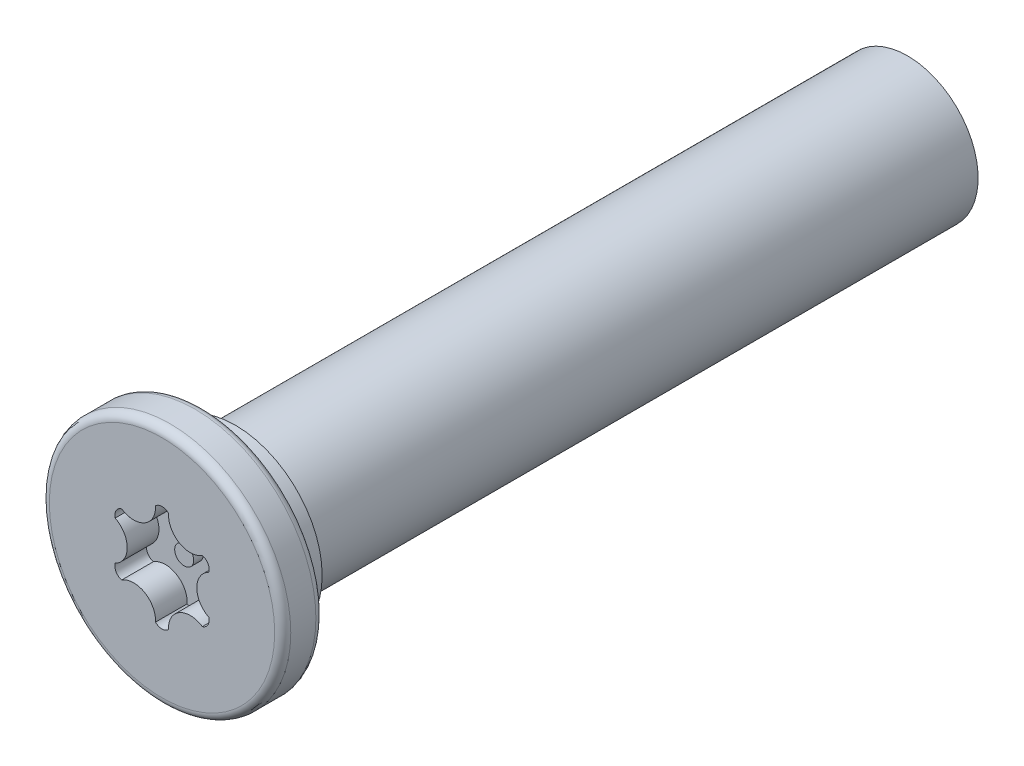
ISO-10303-21;
HEADER;
FILE_DESCRIPTION(('STEP AP214'),'2;1');
FILE_NAME('part.step','',(''),(''),'','','');
FILE_SCHEMA(('AUTOMOTIVE_DESIGN { 1 0 10303 214 1 1 1 1 }'));
ENDSEC;
DATA;
#1=APPLICATION_CONTEXT('core data for automotive mechanical design processes');
#2=APPLICATION_PROTOCOL_DEFINITION('international standard','automotive_design',2000,#1);
#3=PRODUCT_CONTEXT('',#1,'mechanical');
#4=PRODUCT('Part','Part','',(#3));
#5=PRODUCT_RELATED_PRODUCT_CATEGORY('part','',(#4));
#6=PRODUCT_DEFINITION_FORMATION('','',#4);
#7=PRODUCT_DEFINITION_CONTEXT('part definition',#1,'design');
#8=PRODUCT_DEFINITION('design','',#6,#7);
#9=PRODUCT_DEFINITION_SHAPE('','',#8);
#10=(LENGTH_UNIT() NAMED_UNIT(*) SI_UNIT(.MILLI.,.METRE.));
#11=(NAMED_UNIT(*) PLANE_ANGLE_UNIT() SI_UNIT($,.RADIAN.));
#12=(NAMED_UNIT(*) SI_UNIT($,.STERADIAN.) SOLID_ANGLE_UNIT());
#13=UNCERTAINTY_MEASURE_WITH_UNIT(LENGTH_MEASURE(1.E-05),#10,'distance_accuracy_value','');
#14=(GEOMETRIC_REPRESENTATION_CONTEXT(3) GLOBAL_UNCERTAINTY_ASSIGNED_CONTEXT((#13)) GLOBAL_UNIT_ASSIGNED_CONTEXT((#10,
#11,#12)) REPRESENTATION_CONTEXT('',''));
#15=CARTESIAN_POINT('',(0.,0.,0.));
#16=DIRECTION('',(0.,0.,1.));
#17=DIRECTION('',(1.,0.,0.));
#18=AXIS2_PLACEMENT_3D('',#15,#16,#17);
#19=CARTESIAN_POINT('',(0.,0.,0.));
#20=DIRECTION('',(0.,0.,1.));
#21=DIRECTION('',(1.,0.,0.));
#22=AXIS2_PLACEMENT_3D('',#19,#20,#21);
#23=PLANE('',#22);
#24=CARTESIAN_POINT('',(0.,0.,0.));
#25=DIRECTION('',(0.,0.,1.));
#26=DIRECTION('',(1.,0.,0.));
#27=AXIS2_PLACEMENT_3D('',#24,#25,#26);
#28=CIRCLE('',#27,3.55599999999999);
#29=CARTESIAN_POINT('',(3.55599999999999,0.,0.));
#30=VERTEX_POINT('',#29);
#31=EDGE_CURVE('E54',#30,#30,#28,.T.);
#32=ORIENTED_EDGE('',*,*,#31,.T.);
#33=EDGE_LOOP('',(#32));
#34=FACE_BOUND('',#33,.T.);
#35=CARTESIAN_POINT('',(0.893828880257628,1.54815703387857,0.));
#36=DIRECTION('',(0.,0.,1.));
#37=DIRECTION('',(1.,0.,0.));
#38=AXIS2_PLACEMENT_3D('',#35,#36,#37);
#39=CIRCLE('',#38,0.69);
#40=CARTESIAN_POINT('',(0.205060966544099,1.58937306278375,0.));
#41=VERTEX_POINT('',#40);
#42=CARTESIAN_POINT('',(1.27390696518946,0.972274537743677,0.));
#43=VERTEX_POINT('',#42);
#44=EDGE_CURVE('E181',#41,#43,#39,.T.);
#45=ORIENTED_EDGE('',*,*,#44,.T.);
#46=CARTESIAN_POINT('',(1.19884944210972,0.692156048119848,0.));
#47=DIRECTION('',(0.,0.,1.));
#48=DIRECTION('',(1.,0.,0.));
#49=AXIS2_PLACEMENT_3D('',#46,#47,#48);
#50=CIRCLE('',#49,0.29);
#51=CARTESIAN_POINT('',(1.47896793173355,0.617098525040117,0.));
#52=VERTEX_POINT('',#51);
#53=EDGE_CURVE('E61',#43,#52,#50,.F.);
#54=ORIENTED_EDGE('',*,*,#53,.T.);
#55=CARTESIAN_POINT('',(1.78765776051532,0.,0.));
#56=DIRECTION('',(0.,0.,1.));
#57=DIRECTION('',(1.,0.,0.));
#58=AXIS2_PLACEMENT_3D('',#55,#56,#57);
#59=CIRCLE('',#58,0.69);
#60=CARTESIAN_POINT('',(1.47896793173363,-0.617098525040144,0.));
#61=VERTEX_POINT('',#60);
#62=EDGE_CURVE('E111',#52,#61,#59,.T.);
#63=ORIENTED_EDGE('',*,*,#62,.T.);
#64=CARTESIAN_POINT('',(1.1988494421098,-0.692156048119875,0.));
#65=DIRECTION('',(0.,0.,1.));
#66=DIRECTION('',(1.,0.,0.));
#67=AXIS2_PLACEMENT_3D('',#64,#65,#66);
#68=CIRCLE('',#67,0.29);
#69=CARTESIAN_POINT('',(1.27390696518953,-0.972274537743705,0.));
#70=VERTEX_POINT('',#69);
#71=EDGE_CURVE('E216',#61,#70,#68,.F.);
#72=ORIENTED_EDGE('',*,*,#71,.T.);
#73=CARTESIAN_POINT('',(0.893828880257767,-1.54815703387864,0.));
#74=DIRECTION('',(0.,0.,1.));
#75=DIRECTION('',(1.,0.,0.));
#76=AXIS2_PLACEMENT_3D('',#73,#74,#75);
#77=CIRCLE('',#76,0.69);
#78=CARTESIAN_POINT('',(0.205060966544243,-1.5893730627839,0.));
#79=VERTEX_POINT('',#78);
#80=EDGE_CURVE('E160',#70,#79,#77,.T.);
#81=ORIENTED_EDGE('',*,*,#80,.T.);
#82=CARTESIAN_POINT('',(1.43067375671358E-13,-1.3843120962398,0.));
#83=DIRECTION('',(0.,0.,1.));
#84=DIRECTION('',(1.,0.,0.));
#85=AXIS2_PLACEMENT_3D('',#82,#83,#84);
#86=CIRCLE('',#85,0.29);
#87=CARTESIAN_POINT('',(-0.205060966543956,-1.5893730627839,0.));
#88=VERTEX_POINT('',#87);
#89=EDGE_CURVE('E210',#79,#88,#86,.F.);
#90=ORIENTED_EDGE('',*,*,#89,.T.);
#91=CARTESIAN_POINT('',(-0.893828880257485,-1.54815703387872,0.));
#92=DIRECTION('',(0.,0.,1.));
#93=DIRECTION('',(1.,0.,0.));
#94=AXIS2_PLACEMENT_3D('',#91,#92,#93);
#95=CIRCLE('',#94,0.69);
#96=CARTESIAN_POINT('',(-1.27390696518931,-0.97227453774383,0.));
#97=VERTEX_POINT('',#96);
#98=EDGE_CURVE('E206',#88,#97,#95,.T.);
#99=ORIENTED_EDGE('',*,*,#98,.T.);
#100=CARTESIAN_POINT('',(-1.19884944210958,-0.69215604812,0.));
#101=DIRECTION('',(0.,0.,1.));
#102=DIRECTION('',(1.,0.,0.));
#103=AXIS2_PLACEMENT_3D('',#100,#101,#102);
#104=CIRCLE('',#103,0.29);
#105=CARTESIAN_POINT('',(-1.47896793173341,-0.617098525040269,0.));
#106=VERTEX_POINT('',#105);
#107=EDGE_CURVE('E202',#97,#106,#104,.F.);
#108=ORIENTED_EDGE('',*,*,#107,.T.);
#109=CARTESIAN_POINT('',(-1.78765776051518,-1.56674837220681E-13,0.));
#110=DIRECTION('',(0.,0.,1.));
#111=DIRECTION('',(1.,0.,0.));
#112=AXIS2_PLACEMENT_3D('',#109,#110,#111);
#113=CIRCLE('',#112,0.69);
#114=CARTESIAN_POINT('',(-1.47896793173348,0.617098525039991,0.));
#115=VERTEX_POINT('',#114);
#116=EDGE_CURVE('E198',#106,#115,#113,.T.);
#117=ORIENTED_EDGE('',*,*,#116,.T.);
#118=CARTESIAN_POINT('',(-1.19884944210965,0.692156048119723,0.));
#119=DIRECTION('',(0.,0.,1.));
#120=DIRECTION('',(1.,0.,0.));
#121=AXIS2_PLACEMENT_3D('',#118,#119,#120);
#122=CIRCLE('',#121,0.29);
#123=CARTESIAN_POINT('',(-1.27390696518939,0.972274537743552,0.));
#124=VERTEX_POINT('',#123);
#125=EDGE_CURVE('E194',#115,#124,#122,.F.);
#126=ORIENTED_EDGE('',*,*,#125,.T.);
#127=CARTESIAN_POINT('',(-0.893828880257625,1.54815703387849,0.));
#128=DIRECTION('',(0.,0.,1.));
#129=DIRECTION('',(1.,0.,0.));
#130=AXIS2_PLACEMENT_3D('',#127,#128,#129);
#131=CIRCLE('',#130,0.690000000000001);
#132=CARTESIAN_POINT('',(-0.205060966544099,1.58937306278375,0.));
#133=VERTEX_POINT('',#132);
#134=EDGE_CURVE('E190',#124,#133,#131,.T.);
#135=ORIENTED_EDGE('',*,*,#134,.T.);
#136=CARTESIAN_POINT('',(0.,1.38431209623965,0.));
#137=DIRECTION('',(0.,0.,1.));
#138=DIRECTION('',(1.,0.,0.));
#139=AXIS2_PLACEMENT_3D('',#136,#137,#138);
#140=CIRCLE('',#139,0.29);
#141=EDGE_CURVE('E186',#133,#41,#140,.F.);
#142=ORIENTED_EDGE('',*,*,#141,.T.);
#143=EDGE_LOOP('',(#45,#54,#63,#72,#81,#90,#99,#108,#117,#126,#135,#142));
#144=FACE_BOUND('',#143,.T.);
#145=ADVANCED_FACE('F45',(#34,#144),#23,.T.);
#146=CARTESIAN_POINT('',(0.,0.,-1.3));
#147=DIRECTION('',(0.,0.,1.));
#148=DIRECTION('',(1.,0.,0.));
#149=AXIS2_PLACEMENT_3D('',#146,#147,#148);
#150=PLANE('',#149);
#151=CARTESIAN_POINT('',(0.,0.,-1.3));
#152=DIRECTION('',(0.,0.,1.));
#153=DIRECTION('',(1.,0.,0.));
#154=AXIS2_PLACEMENT_3D('',#151,#152,#153);
#155=CIRCLE('',#154,2.738000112);
#156=CARTESIAN_POINT('',(2.738000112,0.,-1.3));
#157=VERTEX_POINT('',#156);
#158=EDGE_CURVE('E11',#157,#157,#155,.F.);
#159=ORIENTED_EDGE('',*,*,#158,.F.);
#160=EDGE_LOOP('',(#159));
#161=FACE_BOUND('',#160,.T.);
#162=CARTESIAN_POINT('',(0.,0.,-1.3));
#163=DIRECTION('',(0.,0.,1.));
#164=DIRECTION('',(1.,0.,0.));
#165=AXIS2_PLACEMENT_3D('',#162,#163,#164);
#166=CIRCLE('',#165,3.55599999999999);
#167=CARTESIAN_POINT('',(3.55599999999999,0.,-1.3));
#168=VERTEX_POINT('',#167);
#169=EDGE_CURVE('E260',#168,#168,#166,.F.);
#170=ORIENTED_EDGE('',*,*,#169,.T.);
#171=EDGE_LOOP('',(#170));
#172=FACE_BOUND('',#171,.T.);
#173=ADVANCED_FACE('F283',(#161,#172),#150,.F.);
#174=CARTESIAN_POINT('',(0.,0.,-1.3));
#175=DIRECTION('',(0.,0.,1.));
#176=DIRECTION('',(1.,0.,0.));
#177=AXIS2_PLACEMENT_3D('',#174,#175,#176);
#178=CYLINDRICAL_SURFACE('',#177,3.80999999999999);
#179=CARTESIAN_POINT('',(0.,0.,-1.046));
#180=DIRECTION('',(0.,0.,1.));
#181=DIRECTION('',(1.,0.,0.));
#182=AXIS2_PLACEMENT_3D('',#179,#180,#181);
#183=CIRCLE('',#182,3.80999999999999);
#184=CARTESIAN_POINT('',(3.80999999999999,0.,-1.046));
#185=VERTEX_POINT('',#184);
#186=EDGE_CURVE('E256',#185,#185,#183,.T.);
#187=ORIENTED_EDGE('',*,*,#186,.T.);
#188=EDGE_LOOP('',(#187));
#189=FACE_BOUND('',#188,.T.);
#190=CARTESIAN_POINT('',(0.,0.,-0.254));
#191=DIRECTION('',(0.,0.,1.));
#192=DIRECTION('',(1.,0.,0.));
#193=AXIS2_PLACEMENT_3D('',#190,#191,#192);
#194=CIRCLE('',#193,3.80999999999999);
#195=CARTESIAN_POINT('',(3.80999999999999,0.,-0.254));
#196=VERTEX_POINT('',#195);
#197=EDGE_CURVE('E225',#196,#196,#194,.F.);
#198=ORIENTED_EDGE('',*,*,#197,.T.);
#199=EDGE_LOOP('',(#198));
#200=FACE_BOUND('',#199,.T.);
#201=ADVANCED_FACE('F289',(#189,#200),#178,.T.);
#202=CARTESIAN_POINT('',(1.19884944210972,0.692156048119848,-1.));
#203=DIRECTION('',(0.,0.,1.));
#204=DIRECTION('',(1.,0.,0.));
#205=AXIS2_PLACEMENT_3D('',#202,#203,#204);
#206=CYLINDRICAL_SURFACE('',#205,0.29);
#207=ORIENTED_EDGE('',*,*,#53,.F.);
#208=DIRECTION('',(0.,0.,1.));
#209=VECTOR('',#208,1.);
#210=CARTESIAN_POINT('',(1.27390696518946,0.972274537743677,-1.));
#211=LINE('',#210,#209);
#212=CARTESIAN_POINT('',(1.27390696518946,0.972274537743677,-1.));
#213=VERTEX_POINT('',#212);
#214=EDGE_CURVE('E178',#213,#43,#211,.T.);
#215=ORIENTED_EDGE('',*,*,#214,.F.);
#216=CARTESIAN_POINT('',(1.19884944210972,0.692156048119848,-1.));
#217=DIRECTION('',(0.,0.,1.));
#218=DIRECTION('',(1.,0.,0.));
#219=AXIS2_PLACEMENT_3D('',#216,#217,#218);
#220=CIRCLE('',#219,0.29);
#221=CARTESIAN_POINT('',(1.47896793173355,0.617098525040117,-1.));
#222=VERTEX_POINT('',#221);
#223=EDGE_CURVE('E221',#213,#222,#220,.F.);
#224=ORIENTED_EDGE('',*,*,#223,.T.);
#225=DIRECTION('',(0.,0.,1.));
#226=VECTOR('',#225,1.);
#227=CARTESIAN_POINT('',(1.47896793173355,0.617098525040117,-1.));
#228=LINE('',#227,#226);
#229=EDGE_CURVE('E222',#222,#52,#228,.T.);
#230=ORIENTED_EDGE('',*,*,#229,.T.);
#231=EDGE_LOOP('',(#207,#215,#224,#230));
#232=FACE_BOUND('',#231,.T.);
#233=ADVANCED_FACE('F294',(#232),#206,.F.);
#234=CARTESIAN_POINT('',(1.78765776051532,0.,-1.));
#235=DIRECTION('',(0.,0.,1.));
#236=DIRECTION('',(1.,0.,0.));
#237=AXIS2_PLACEMENT_3D('',#234,#235,#236);
#238=CYLINDRICAL_SURFACE('',#237,0.69);
#239=ORIENTED_EDGE('',*,*,#62,.F.);
#240=ORIENTED_EDGE('',*,*,#229,.F.);
#241=CARTESIAN_POINT('',(1.78765776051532,0.,-1.));
#242=DIRECTION('',(0.,0.,1.));
#243=DIRECTION('',(1.,0.,0.));
#244=AXIS2_PLACEMENT_3D('',#241,#242,#243);
#245=CIRCLE('',#244,0.69);
#246=CARTESIAN_POINT('',(1.47896793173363,-0.617098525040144,-1.));
#247=VERTEX_POINT('',#246);
#248=EDGE_CURVE('E70',#222,#247,#245,.T.);
#249=ORIENTED_EDGE('',*,*,#248,.T.);
#250=DIRECTION('',(0.,0.,1.));
#251=VECTOR('',#250,1.);
#252=CARTESIAN_POINT('',(1.47896793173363,-0.617098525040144,-1.));
#253=LINE('',#252,#251);
#254=EDGE_CURVE('E151',#247,#61,#253,.T.);
#255=ORIENTED_EDGE('',*,*,#254,.T.);
#256=EDGE_LOOP('',(#239,#240,#249,#255));
#257=FACE_BOUND('',#256,.T.);
#258=ADVANCED_FACE('F301',(#257),#238,.T.);
#259=CARTESIAN_POINT('',(1.1988494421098,-0.692156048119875,-1.));
#260=DIRECTION('',(0.,0.,1.));
#261=DIRECTION('',(1.,0.,0.));
#262=AXIS2_PLACEMENT_3D('',#259,#260,#261);
#263=CYLINDRICAL_SURFACE('',#262,0.29);
#264=ORIENTED_EDGE('',*,*,#71,.F.);
#265=ORIENTED_EDGE('',*,*,#254,.F.);
#266=CARTESIAN_POINT('',(1.1988494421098,-0.692156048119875,-1.));
#267=DIRECTION('',(0.,0.,1.));
#268=DIRECTION('',(1.,0.,0.));
#269=AXIS2_PLACEMENT_3D('',#266,#267,#268);
#270=CIRCLE('',#269,0.29);
#271=CARTESIAN_POINT('',(1.27390696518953,-0.972274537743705,-1.));
#272=VERTEX_POINT('',#271);
#273=EDGE_CURVE('E145',#247,#272,#270,.F.);
#274=ORIENTED_EDGE('',*,*,#273,.T.);
#275=DIRECTION('',(0.,0.,1.));
#276=VECTOR('',#275,1.);
#277=CARTESIAN_POINT('',(1.27390696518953,-0.972274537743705,-1.));
#278=LINE('',#277,#276);
#279=EDGE_CURVE('E149',#272,#70,#278,.T.);
#280=ORIENTED_EDGE('',*,*,#279,.T.);
#281=EDGE_LOOP('',(#264,#265,#274,#280));
#282=FACE_BOUND('',#281,.T.);
#283=ADVANCED_FACE('F148',(#282),#263,.F.);
#284=CARTESIAN_POINT('',(0.893828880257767,-1.54815703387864,-1.));
#285=DIRECTION('',(0.,0.,1.));
#286=DIRECTION('',(1.,0.,0.));
#287=AXIS2_PLACEMENT_3D('',#284,#285,#286);
#288=CYLINDRICAL_SURFACE('',#287,0.69);
#289=ORIENTED_EDGE('',*,*,#80,.F.);
#290=ORIENTED_EDGE('',*,*,#279,.F.);
#291=CARTESIAN_POINT('',(0.893828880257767,-1.54815703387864,-1.));
#292=DIRECTION('',(0.,0.,1.));
#293=DIRECTION('',(1.,0.,0.));
#294=AXIS2_PLACEMENT_3D('',#291,#292,#293);
#295=CIRCLE('',#294,0.69);
#296=CARTESIAN_POINT('',(0.205060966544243,-1.5893730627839,-1.));
#297=VERTEX_POINT('',#296);
#298=EDGE_CURVE('E154',#272,#297,#295,.T.);
#299=ORIENTED_EDGE('',*,*,#298,.T.);
#300=DIRECTION('',(0.,0.,1.));
#301=VECTOR('',#300,1.);
#302=CARTESIAN_POINT('',(0.205060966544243,-1.5893730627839,-1.));
#303=LINE('',#302,#301);
#304=EDGE_CURVE('E163',#297,#79,#303,.T.);
#305=ORIENTED_EDGE('',*,*,#304,.T.);
#306=EDGE_LOOP('',(#289,#290,#299,#305));
#307=FACE_BOUND('',#306,.T.);
#308=ADVANCED_FACE('F157',(#307),#288,.T.);
#309=CARTESIAN_POINT('',(1.43067375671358E-13,-1.3843120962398,-1.));
#310=DIRECTION('',(0.,0.,1.));
#311=DIRECTION('',(1.,0.,0.));
#312=AXIS2_PLACEMENT_3D('',#309,#310,#311);
#313=CYLINDRICAL_SURFACE('',#312,0.29);
#314=ORIENTED_EDGE('',*,*,#89,.F.);
#315=ORIENTED_EDGE('',*,*,#304,.F.);
#316=CARTESIAN_POINT('',(1.43067375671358E-13,-1.3843120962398,-1.));
#317=DIRECTION('',(0.,0.,1.));
#318=DIRECTION('',(1.,0.,0.));
#319=AXIS2_PLACEMENT_3D('',#316,#317,#318);
#320=CIRCLE('',#319,0.29);
#321=CARTESIAN_POINT('',(-0.205060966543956,-1.5893730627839,-1.));
#322=VERTEX_POINT('',#321);
#323=EDGE_CURVE('E168',#297,#322,#320,.F.);
#324=ORIENTED_EDGE('',*,*,#323,.T.);
#325=DIRECTION('',(0.,0.,1.));
#326=VECTOR('',#325,1.);
#327=CARTESIAN_POINT('',(-0.205060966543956,-1.5893730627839,-1.));
#328=LINE('',#327,#326);
#329=EDGE_CURVE('E230',#322,#88,#328,.T.);
#330=ORIENTED_EDGE('',*,*,#329,.T.);
#331=EDGE_LOOP('',(#314,#315,#324,#330));
#332=FACE_BOUND('',#331,.T.);
#333=ADVANCED_FACE('F318',(#332),#313,.F.);
#334=CARTESIAN_POINT('',(-0.893828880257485,-1.54815703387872,-1.));
#335=DIRECTION('',(0.,0.,1.));
#336=DIRECTION('',(1.,0.,0.));
#337=AXIS2_PLACEMENT_3D('',#334,#335,#336);
#338=CYLINDRICAL_SURFACE('',#337,0.69);
#339=ORIENTED_EDGE('',*,*,#98,.F.);
#340=ORIENTED_EDGE('',*,*,#329,.F.);
#341=CARTESIAN_POINT('',(-0.893828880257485,-1.54815703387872,-1.));
#342=DIRECTION('',(0.,0.,1.));
#343=DIRECTION('',(1.,0.,0.));
#344=AXIS2_PLACEMENT_3D('',#341,#342,#343);
#345=CIRCLE('',#344,0.69);
#346=CARTESIAN_POINT('',(-1.27390696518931,-0.97227453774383,-1.));
#347=VERTEX_POINT('',#346);
#348=EDGE_CURVE('E172',#322,#347,#345,.T.);
#349=ORIENTED_EDGE('',*,*,#348,.T.);
#350=DIRECTION('',(0.,0.,1.));
#351=VECTOR('',#350,1.);
#352=CARTESIAN_POINT('',(-1.27390696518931,-0.97227453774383,-1.));
#353=LINE('',#352,#351);
#354=EDGE_CURVE('E233',#347,#97,#353,.T.);
#355=ORIENTED_EDGE('',*,*,#354,.T.);
#356=EDGE_LOOP('',(#339,#340,#349,#355));
#357=FACE_BOUND('',#356,.T.);
#358=ADVANCED_FACE('F321',(#357),#338,.T.);
#359=CARTESIAN_POINT('',(-1.19884944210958,-0.69215604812,-1.));
#360=DIRECTION('',(0.,0.,1.));
#361=DIRECTION('',(1.,0.,0.));
#362=AXIS2_PLACEMENT_3D('',#359,#360,#361);
#363=CYLINDRICAL_SURFACE('',#362,0.29);
#364=ORIENTED_EDGE('',*,*,#107,.F.);
#365=ORIENTED_EDGE('',*,*,#354,.F.);
#366=CARTESIAN_POINT('',(-1.19884944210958,-0.69215604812,-1.));
#367=DIRECTION('',(0.,0.,1.));
#368=DIRECTION('',(1.,0.,0.));
#369=AXIS2_PLACEMENT_3D('',#366,#367,#368);
#370=CIRCLE('',#369,0.29);
#371=CARTESIAN_POINT('',(-1.47896793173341,-0.617098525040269,-1.));
#372=VERTEX_POINT('',#371);
#373=EDGE_CURVE('E374',#347,#372,#370,.F.);
#374=ORIENTED_EDGE('',*,*,#373,.T.);
#375=DIRECTION('',(0.,0.,1.));
#376=VECTOR('',#375,1.);
#377=CARTESIAN_POINT('',(-1.47896793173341,-0.617098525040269,-1.));
#378=LINE('',#377,#376);
#379=EDGE_CURVE('E236',#372,#106,#378,.T.);
#380=ORIENTED_EDGE('',*,*,#379,.T.);
#381=EDGE_LOOP('',(#364,#365,#374,#380));
#382=FACE_BOUND('',#381,.T.);
#383=ADVANCED_FACE('F325',(#382),#363,.F.);
#384=CARTESIAN_POINT('',(-1.78765776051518,-1.56674837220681E-13,-1.));
#385=DIRECTION('',(0.,0.,1.));
#386=DIRECTION('',(1.,0.,0.));
#387=AXIS2_PLACEMENT_3D('',#384,#385,#386);
#388=CYLINDRICAL_SURFACE('',#387,0.69);
#389=ORIENTED_EDGE('',*,*,#116,.F.);
#390=ORIENTED_EDGE('',*,*,#379,.F.);
#391=CARTESIAN_POINT('',(-1.78765776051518,-1.56674837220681E-13,-1.));
#392=DIRECTION('',(0.,0.,1.));
#393=DIRECTION('',(1.,0.,0.));
#394=AXIS2_PLACEMENT_3D('',#391,#392,#393);
#395=CIRCLE('',#394,0.69);
#396=CARTESIAN_POINT('',(-1.47896793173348,0.617098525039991,-1.));
#397=VERTEX_POINT('',#396);
#398=EDGE_CURVE('E371',#372,#397,#395,.T.);
#399=ORIENTED_EDGE('',*,*,#398,.T.);
#400=DIRECTION('',(0.,0.,1.));
#401=VECTOR('',#400,1.);
#402=CARTESIAN_POINT('',(-1.47896793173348,0.617098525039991,-1.));
#403=LINE('',#402,#401);
#404=EDGE_CURVE('E239',#397,#115,#403,.T.);
#405=ORIENTED_EDGE('',*,*,#404,.T.);
#406=EDGE_LOOP('',(#389,#390,#399,#405));
#407=FACE_BOUND('',#406,.T.);
#408=ADVANCED_FACE('F329',(#407),#388,.T.);
#409=CARTESIAN_POINT('',(-1.19884944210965,0.692156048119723,-1.));
#410=DIRECTION('',(0.,0.,1.));
#411=DIRECTION('',(1.,0.,0.));
#412=AXIS2_PLACEMENT_3D('',#409,#410,#411);
#413=CYLINDRICAL_SURFACE('',#412,0.29);
#414=ORIENTED_EDGE('',*,*,#125,.F.);
#415=ORIENTED_EDGE('',*,*,#404,.F.);
#416=CARTESIAN_POINT('',(-1.19884944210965,0.692156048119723,-1.));
#417=DIRECTION('',(0.,0.,1.));
#418=DIRECTION('',(1.,0.,0.));
#419=AXIS2_PLACEMENT_3D('',#416,#417,#418);
#420=CIRCLE('',#419,0.29);
#421=CARTESIAN_POINT('',(-1.27390696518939,0.972274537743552,-1.));
#422=VERTEX_POINT('',#421);
#423=EDGE_CURVE('E364',#397,#422,#420,.F.);
#424=ORIENTED_EDGE('',*,*,#423,.T.);
#425=DIRECTION('',(0.,0.,1.));
#426=VECTOR('',#425,1.);
#427=CARTESIAN_POINT('',(-1.27390696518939,0.972274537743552,-1.));
#428=LINE('',#427,#426);
#429=EDGE_CURVE('E242',#422,#124,#428,.T.);
#430=ORIENTED_EDGE('',*,*,#429,.T.);
#431=EDGE_LOOP('',(#414,#415,#424,#430));
#432=FACE_BOUND('',#431,.T.);
#433=ADVANCED_FACE('F333',(#432),#413,.F.);
#434=CARTESIAN_POINT('',(-0.893828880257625,1.54815703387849,-1.));
#435=DIRECTION('',(0.,0.,1.));
#436=DIRECTION('',(1.,0.,0.));
#437=AXIS2_PLACEMENT_3D('',#434,#435,#436);
#438=CYLINDRICAL_SURFACE('',#437,0.690000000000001);
#439=ORIENTED_EDGE('',*,*,#134,.F.);
#440=ORIENTED_EDGE('',*,*,#429,.F.);
#441=CARTESIAN_POINT('',(-0.893828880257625,1.54815703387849,-1.));
#442=DIRECTION('',(0.,0.,1.));
#443=DIRECTION('',(1.,0.,0.));
#444=AXIS2_PLACEMENT_3D('',#441,#442,#443);
#445=CIRCLE('',#444,0.690000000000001);
#446=CARTESIAN_POINT('',(-0.205060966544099,1.58937306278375,-1.));
#447=VERTEX_POINT('',#446);
#448=EDGE_CURVE('E360',#422,#447,#445,.T.);
#449=ORIENTED_EDGE('',*,*,#448,.T.);
#450=DIRECTION('',(0.,0.,1.));
#451=VECTOR('',#450,1.);
#452=CARTESIAN_POINT('',(-0.205060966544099,1.58937306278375,-1.));
#453=LINE('',#452,#451);
#454=EDGE_CURVE('E245',#447,#133,#453,.T.);
#455=ORIENTED_EDGE('',*,*,#454,.T.);
#456=EDGE_LOOP('',(#439,#440,#449,#455));
#457=FACE_BOUND('',#456,.T.);
#458=ADVANCED_FACE('F337',(#457),#438,.T.);
#459=CARTESIAN_POINT('',(0.,1.38431209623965,-1.));
#460=DIRECTION('',(0.,0.,1.));
#461=DIRECTION('',(1.,0.,0.));
#462=AXIS2_PLACEMENT_3D('',#459,#460,#461);
#463=CYLINDRICAL_SURFACE('',#462,0.29);
#464=ORIENTED_EDGE('',*,*,#141,.F.);
#465=ORIENTED_EDGE('',*,*,#454,.F.);
#466=CARTESIAN_POINT('',(0.,1.38431209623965,-1.));
#467=DIRECTION('',(0.,0.,1.));
#468=DIRECTION('',(1.,0.,0.));
#469=AXIS2_PLACEMENT_3D('',#466,#467,#468);
#470=CIRCLE('',#469,0.29);
#471=CARTESIAN_POINT('',(0.205060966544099,1.58937306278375,-1.));
#472=VERTEX_POINT('',#471);
#473=EDGE_CURVE('E357',#447,#472,#470,.F.);
#474=ORIENTED_EDGE('',*,*,#473,.T.);
#475=DIRECTION('',(0.,0.,1.));
#476=VECTOR('',#475,1.);
#477=CARTESIAN_POINT('',(0.205060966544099,1.58937306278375,-1.));
#478=LINE('',#477,#476);
#479=EDGE_CURVE('E248',#472,#41,#478,.T.);
#480=ORIENTED_EDGE('',*,*,#479,.T.);
#481=EDGE_LOOP('',(#464,#465,#474,#480));
#482=FACE_BOUND('',#481,.T.);
#483=ADVANCED_FACE('F341',(#482),#463,.F.);
#484=CARTESIAN_POINT('',(0.893828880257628,1.54815703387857,-1.));
#485=DIRECTION('',(0.,0.,1.));
#486=DIRECTION('',(1.,0.,0.));
#487=AXIS2_PLACEMENT_3D('',#484,#485,#486);
#488=CYLINDRICAL_SURFACE('',#487,0.69);
#489=ORIENTED_EDGE('',*,*,#44,.F.);
#490=ORIENTED_EDGE('',*,*,#479,.F.);
#491=CARTESIAN_POINT('',(0.893828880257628,1.54815703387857,-1.));
#492=DIRECTION('',(0.,0.,1.));
#493=DIRECTION('',(1.,0.,0.));
#494=AXIS2_PLACEMENT_3D('',#491,#492,#493);
#495=CIRCLE('',#494,0.69);
#496=EDGE_CURVE('E118',#472,#213,#495,.T.);
#497=ORIENTED_EDGE('',*,*,#496,.T.);
#498=ORIENTED_EDGE('',*,*,#214,.T.);
#499=EDGE_LOOP('',(#489,#490,#497,#498));
#500=FACE_BOUND('',#499,.T.);
#501=ADVANCED_FACE('F344',(#500),#488,.T.);
#502=CARTESIAN_POINT('',(0.,0.,-1.));
#503=DIRECTION('',(0.,0.,1.));
#504=DIRECTION('',(1.,0.,0.));
#505=AXIS2_PLACEMENT_3D('',#502,#503,#504);
#506=PLANE('',#505);
#507=CARTESIAN_POINT('',(0.,0.,-1.));
#508=DIRECTION('',(0.,0.,1.));
#509=DIRECTION('',(1.,0.,0.));
#510=AXIS2_PLACEMENT_3D('',#507,#508,#509);
#511=CIRCLE('',#510,0.3);
#512=CARTESIAN_POINT('',(0.3,0.,-1.));
#513=VERTEX_POINT('',#512);
#514=EDGE_CURVE('E396',#513,#513,#511,.T.);
#515=ORIENTED_EDGE('',*,*,#514,.F.);
#516=EDGE_LOOP('',(#515));
#517=FACE_BOUND('',#516,.T.);
#518=ORIENTED_EDGE('',*,*,#223,.F.);
#519=ORIENTED_EDGE('',*,*,#496,.F.);
#520=ORIENTED_EDGE('',*,*,#473,.F.);
#521=ORIENTED_EDGE('',*,*,#448,.F.);
#522=ORIENTED_EDGE('',*,*,#423,.F.);
#523=ORIENTED_EDGE('',*,*,#398,.F.);
#524=ORIENTED_EDGE('',*,*,#373,.F.);
#525=ORIENTED_EDGE('',*,*,#348,.F.);
#526=ORIENTED_EDGE('',*,*,#323,.F.);
#527=ORIENTED_EDGE('',*,*,#298,.F.);
#528=ORIENTED_EDGE('',*,*,#273,.F.);
#529=ORIENTED_EDGE('',*,*,#248,.F.);
#530=EDGE_LOOP('',(#518,#519,#520,#521,#522,#523,#524,#525,#526,#527,#528,#529));
#531=FACE_BOUND('',#530,.T.);
#532=ADVANCED_FACE('F166',(#517,#531),#506,.T.);
#533=CARTESIAN_POINT('',(0.,0.,-1.046));
#534=DIRECTION('',(0.,0.,1.));
#535=DIRECTION('',(1.,0.,0.));
#536=AXIS2_PLACEMENT_3D('',#533,#534,#535);
#537=TOROIDAL_SURFACE('',#536,3.55599999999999,0.254);
#538=ORIENTED_EDGE('',*,*,#169,.F.);
#539=EDGE_LOOP('',(#538));
#540=FACE_BOUND('',#539,.T.);
#541=ORIENTED_EDGE('',*,*,#186,.F.);
#542=EDGE_LOOP('',(#541));
#543=FACE_BOUND('',#542,.T.);
#544=ADVANCED_FACE('F271',(#540,#543),#537,.T.);
#545=CARTESIAN_POINT('',(0.,0.,-0.254));
#546=DIRECTION('',(0.,0.,1.));
#547=DIRECTION('',(1.,0.,0.));
#548=AXIS2_PLACEMENT_3D('',#545,#546,#547);
#549=TOROIDAL_SURFACE('',#548,3.55599999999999,0.254);
#550=ORIENTED_EDGE('',*,*,#197,.F.);
#551=EDGE_LOOP('',(#550));
#552=FACE_BOUND('',#551,.T.);
#553=ORIENTED_EDGE('',*,*,#31,.F.);
#554=EDGE_LOOP('',(#553));
#555=FACE_BOUND('',#554,.T.);
#556=ADVANCED_FACE('F47',(#552,#555),#549,.T.);
#557=CARTESIAN_POINT('',(0.,0.,-2.316));
#558=DIRECTION('',(0.,0.,-1.));
#559=DIRECTION('',(-1.,0.,0.));
#560=AXIS2_PLACEMENT_3D('',#557,#558,#559);
#561=PLANE('',#560);
#562=CARTESIAN_POINT('',(0.,0.,-2.316));
#563=DIRECTION('',(0.,0.,-1.));
#564=DIRECTION('',(-1.,0.,0.));
#565=AXIS2_PLACEMENT_3D('',#562,#563,#564);
#566=CIRCLE('',#565,2.738000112);
#567=CARTESIAN_POINT('',(-2.738000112,0.,-2.316));
#568=VERTEX_POINT('',#567);
#569=EDGE_CURVE('E182',#568,#568,#566,.T.);
#570=ORIENTED_EDGE('',*,*,#569,.T.);
#571=EDGE_LOOP('',(#570));
#572=FACE_BOUND('',#571,.T.);
#573=CARTESIAN_POINT('',(0.,0.,-2.316));
#574=DIRECTION('',(0.,0.,-1.));
#575=DIRECTION('',(-1.,0.,0.));
#576=AXIS2_PLACEMENT_3D('',#573,#574,#575);
#577=CIRCLE('',#576,2.230000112);
#578=CARTESIAN_POINT('',(-2.230000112,0.,-2.316));
#579=VERTEX_POINT('',#578);
#580=EDGE_CURVE('E400',#579,#579,#577,.T.);
#581=ORIENTED_EDGE('',*,*,#580,.F.);
#582=EDGE_LOOP('',(#581));
#583=FACE_BOUND('',#582,.T.);
#584=ADVANCED_FACE('F270',(#572,#583),#561,.T.);
#585=CARTESIAN_POINT('',(0.,0.,-2.316));
#586=DIRECTION('',(0.,0.,1.));
#587=DIRECTION('',(1.,0.,0.));
#588=AXIS2_PLACEMENT_3D('',#585,#586,#587);
#589=CYLINDRICAL_SURFACE('',#588,2.738000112);
#590=ORIENTED_EDGE('',*,*,#569,.F.);
#591=EDGE_LOOP('',(#590));
#592=FACE_BOUND('',#591,.T.);
#593=ORIENTED_EDGE('',*,*,#158,.T.);
#594=EDGE_LOOP('',(#593));
#595=FACE_BOUND('',#594,.T.);
#596=ADVANCED_FACE('F277',(#592,#595),#589,.T.);
#597=CARTESIAN_POINT('',(0.,0.,-0.7));
#598=DIRECTION('',(0.,0.,-1.));
#599=DIRECTION('',(-1.,0.,0.));
#600=AXIS2_PLACEMENT_3D('',#597,#598,#599);
#601=CYLINDRICAL_SURFACE('',#600,0.3);
#602=CARTESIAN_POINT('',(0.,0.,-0.7));
#603=DIRECTION('',(0.,0.,1.));
#604=DIRECTION('',(1.,0.,0.));
#605=AXIS2_PLACEMENT_3D('',#602,#603,#604);
#606=CIRCLE('',#605,0.3);
#607=CARTESIAN_POINT('',(0.3,0.,-0.7));
#608=VERTEX_POINT('',#607);
#609=EDGE_CURVE('E395',#608,#608,#606,.T.);
#610=ORIENTED_EDGE('',*,*,#609,.F.);
#611=EDGE_LOOP('',(#610));
#612=FACE_BOUND('',#611,.T.);
#613=ORIENTED_EDGE('',*,*,#514,.T.);
#614=EDGE_LOOP('',(#613));
#615=FACE_BOUND('',#614,.T.);
#616=ADVANCED_FACE('F424',(#612,#615),#601,.T.);
#617=CARTESIAN_POINT('',(0.,0.,-0.7));
#618=DIRECTION('',(0.,0.,1.));
#619=DIRECTION('',(1.,0.,0.));
#620=AXIS2_PLACEMENT_3D('',#617,#618,#619);
#621=PLANE('',#620);
#622=ORIENTED_EDGE('',*,*,#609,.T.);
#623=EDGE_LOOP('',(#622));
#624=FACE_BOUND('',#623,.T.);
#625=ADVANCED_FACE('F416',(#624),#621,.T.);
#626=CARTESIAN_POINT('',(0.,0.,-23.525));
#627=DIRECTION('',(0.,0.,1.));
#628=DIRECTION('',(1.,0.,0.));
#629=AXIS2_PLACEMENT_3D('',#626,#627,#628);
#630=CYLINDRICAL_SURFACE('',#629,2.230000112);
#631=ORIENTED_EDGE('',*,*,#580,.T.);
#632=EDGE_LOOP('',(#631));
#633=FACE_BOUND('',#632,.T.);
#634=CARTESIAN_POINT('',(0.,0.,-23.525));
#635=DIRECTION('',(0.,0.,-1.));
#636=DIRECTION('',(-1.,0.,0.));
#637=AXIS2_PLACEMENT_3D('',#634,#635,#636);
#638=CIRCLE('',#637,2.230000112);
#639=CARTESIAN_POINT('',(-2.230000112,0.,-23.525));
#640=VERTEX_POINT('',#639);
#641=EDGE_CURVE('E407',#640,#640,#638,.T.);
#642=ORIENTED_EDGE('',*,*,#641,.F.);
#643=EDGE_LOOP('',(#642));
#644=FACE_BOUND('',#643,.T.);
#645=ADVANCED_FACE('F414',(#633,#644),#630,.T.);
#646=CARTESIAN_POINT('',(0.,0.,-23.525));
#647=DIRECTION('',(0.,0.,-1.));
#648=DIRECTION('',(-1.,0.,0.));
#649=AXIS2_PLACEMENT_3D('',#646,#647,#648);
#650=PLANE('',#649);
#651=ORIENTED_EDGE('',*,*,#641,.T.);
#652=EDGE_LOOP('',(#651));
#653=FACE_BOUND('',#652,.T.);
#654=ADVANCED_FACE('F412',(#653),#650,.T.);
#655=CLOSED_SHELL('',(#145,#173,#201,#233,#258,#283,#308,#333,#358,#383,#408,#433,#458,#483,
#501,#532,#544,#556,#584,#596,#616,#625,#645,#654));
#656=MANIFOLD_SOLID_BREP('B2',#655);
#657=ADVANCED_BREP_SHAPE_REPRESENTATION('',(#18,#656),#14);
#658=SHAPE_DEFINITION_REPRESENTATION(#9,#657);
ENDSEC;
END-ISO-10303-21;
